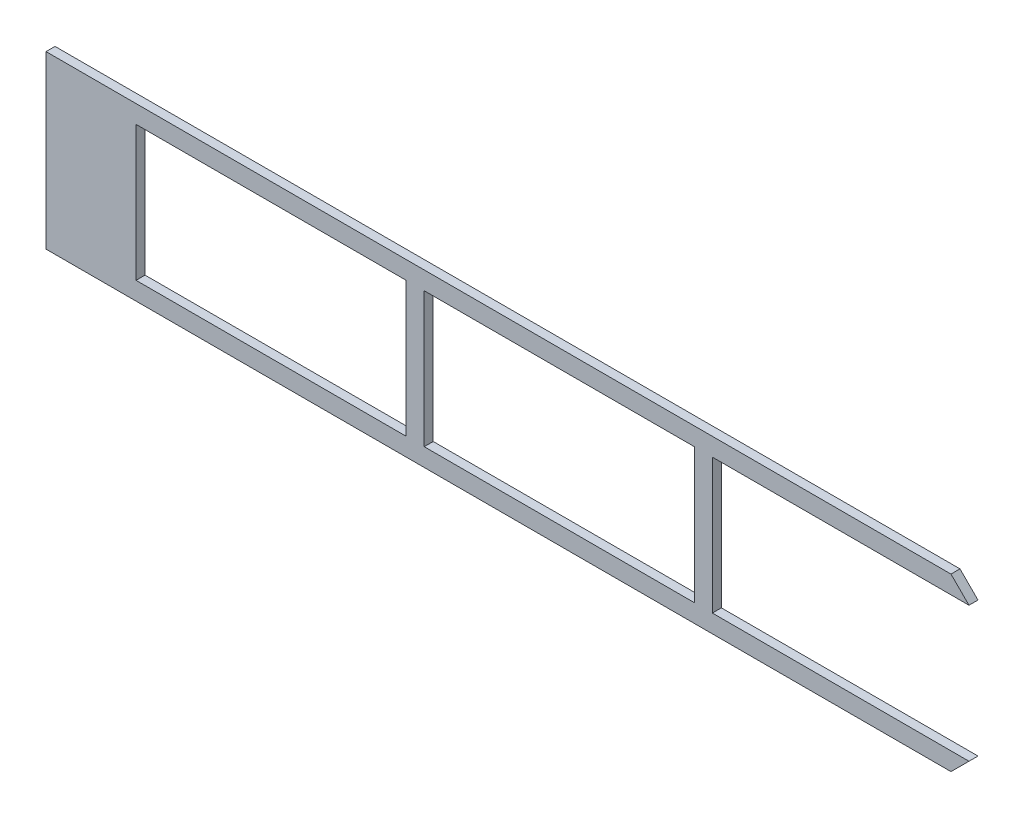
from build123d import *

# Parameters (mm, degrees)
F_1_POSTE_W        = 30
F_1_POSTE_H        = 15
BOSS_EXTRU_1_DEPTH = 1


with BuildPart() as part:
    # 1 poste → Boss.-Extru.1 (new body)
    with BuildSketch(Plane.XY):
        Polygon((-10, 17), (90.5, 17), (92.5, 15), (64, 15), (64, 0), (92.5, 0), (90.5, -2), (-10, -2), align=None)
        with Locations((15, 7.5)):
            Rectangle(F_1_POSTE_W, F_1_POSTE_H, mode=Mode.SUBTRACT)
        with Locations((47, 7.5)):
            Rectangle(F_1_POSTE_W, F_1_POSTE_H, mode=Mode.SUBTRACT)
    extrude(amount=BOSS_EXTRU_1_DEPTH)


solid = part.part
